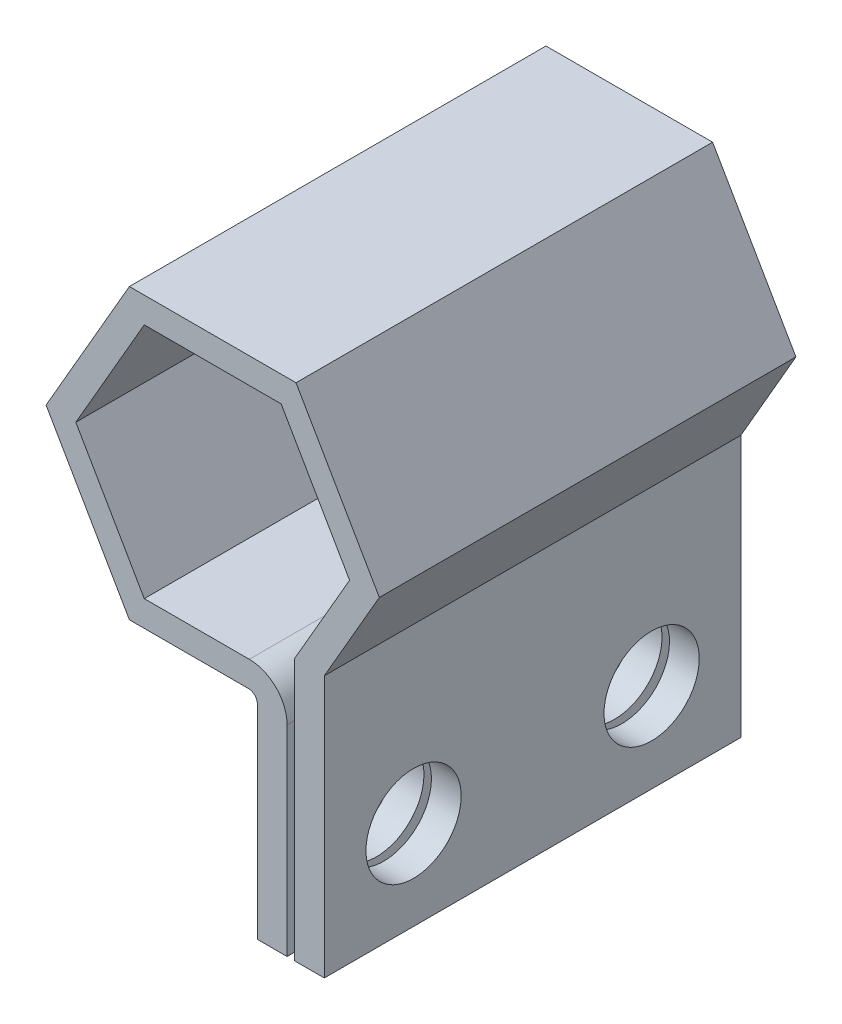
from build123d import *

# Parameters (mm, degrees)
BOSS_EXTRUDE1_DEPTH = 14
CUT_EXTRUDE1_START  = -2.25
SKETCH2_R           = 1.6
CUT_EXTRUDE1_DEPTH  = 2.25


with BuildPart() as part:
    # Sketch1 → Boss-Extrude1 (new body)
    with BuildSketch(Plane.XY):
        with BuildLine():
            Line((5.6, 0), (2.8, 4.849742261))
            Line((2.8, 4.849742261), (-2.8, 4.849742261))
            Line((-2.8, 4.849742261), (-5.6, 0))
            Line((-5.6, 0), (-2.8, -4.849742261))
            Line((-2.8, -4.849742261), (1.2, -4.849742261))
            ThreePointArc((1.2, -4.849742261), (1.412132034, -4.937610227), (1.5, -5.149742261))
            Line((1.5, -5.149742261), (1.5, -12))
            Line((1.5, -12), (2.5, -12))
            Line((2.5, -12), (2.5, -5.253716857))
            ThreePointArc((2.5, -5.253716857), (2.128025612, -4.355691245), (1.23, -3.983716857))
            Line((1.23, -3.983716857), (-2.3, -3.983716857))
            Line((-2.3, -3.983716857), (-4.6, 0))
            Line((-4.6, 0), (-2.3, 3.983716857))
            Line((-2.3, 3.983716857), (2.3, 3.983716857))
            Line((2.3, 3.983716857), (4.6, 0))
            Line((4.6, 0), (2.75, -3.204293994))
            Line((2.75, -3.204293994), (2.75, -12))
            Line((2.75, -12), (3.75, -12))
            Line((3.75, -12), (3.75, -3.204293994))
            Line((3.75, -3.204293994), (5.6, 0))
        make_face()
    extrude(amount=BOSS_EXTRUDE1_DEPTH)

    # Sketch2 → Cut-Extrude1 (cut)
    with BuildSketch(Plane(origin=(3.75, 0, 0), x_dir=(0, 0, -1), z_dir=(1, 0, 0)).offset(CUT_EXTRUDE1_START)):
        with Locations(Location((-11, -9, 0), (0, 0, 90))):
            Circle(SKETCH2_R)
        with Locations(Location((-3, -9, 0), (0, 0, 90))):
            Circle(SKETCH2_R)
    extrude(amount=CUT_EXTRUDE1_DEPTH, mode=Mode.SUBTRACT)


solid = part.part
